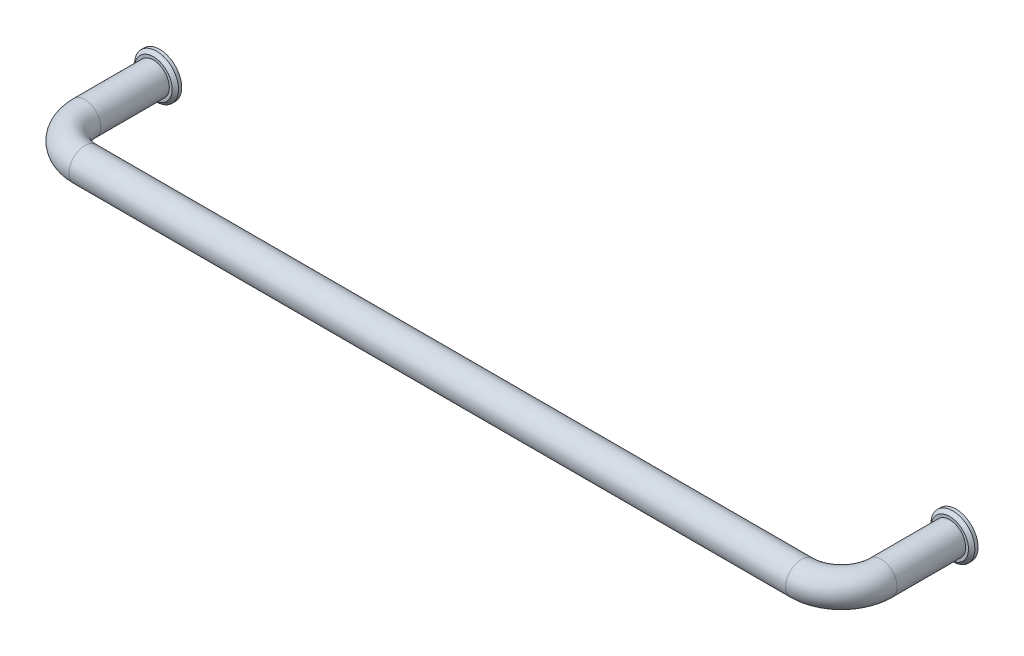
ISO-10303-21;
HEADER;
FILE_DESCRIPTION(('STEP AP214'),'2;1');
FILE_NAME('part.step','',(''),(''),'','','');
FILE_SCHEMA(('AUTOMOTIVE_DESIGN { 1 0 10303 214 1 1 1 1 }'));
ENDSEC;
DATA;
#1=APPLICATION_CONTEXT('core data for automotive mechanical design processes');
#2=APPLICATION_PROTOCOL_DEFINITION('international standard','automotive_design',2000,#1);
#3=PRODUCT_CONTEXT('',#1,'mechanical');
#4=PRODUCT('Part','Part','',(#3));
#5=PRODUCT_RELATED_PRODUCT_CATEGORY('part','',(#4));
#6=PRODUCT_DEFINITION_FORMATION('','',#4);
#7=PRODUCT_DEFINITION_CONTEXT('part definition',#1,'design');
#8=PRODUCT_DEFINITION('design','',#6,#7);
#9=PRODUCT_DEFINITION_SHAPE('','',#8);
#10=(LENGTH_UNIT() NAMED_UNIT(*) SI_UNIT(.MILLI.,.METRE.));
#11=(NAMED_UNIT(*) PLANE_ANGLE_UNIT() SI_UNIT($,.RADIAN.));
#12=(NAMED_UNIT(*) SI_UNIT($,.STERADIAN.) SOLID_ANGLE_UNIT());
#13=UNCERTAINTY_MEASURE_WITH_UNIT(LENGTH_MEASURE(1.E-05),#10,'distance_accuracy_value','');
#14=(GEOMETRIC_REPRESENTATION_CONTEXT(3) GLOBAL_UNCERTAINTY_ASSIGNED_CONTEXT((#13)) GLOBAL_UNIT_ASSIGNED_CONTEXT((#10,
#11,#12)) REPRESENTATION_CONTEXT('',''));
#15=CARTESIAN_POINT('',(0.,0.,0.));
#16=DIRECTION('',(0.,0.,1.));
#17=DIRECTION('',(1.,0.,0.));
#18=AXIS2_PLACEMENT_3D('',#15,#16,#17);
#19=CARTESIAN_POINT('',(0.,0.,0.));
#20=DIRECTION('',(0.,0.,1.));
#21=DIRECTION('',(0.,1.,0.));
#22=AXIS2_PLACEMENT_3D('',#19,#20,#21);
#23=PLANE('',#22);
#24=CARTESIAN_POINT('',(0.,0.,0.));
#25=DIRECTION('',(0.,0.,1.));
#26=DIRECTION('',(1.,0.,0.));
#27=AXIS2_PLACEMENT_3D('',#24,#25,#26);
#28=CIRCLE('',#27,6.9);
#29=CARTESIAN_POINT('',(6.9,0.,0.));
#30=VERTEX_POINT('',#29);
#31=EDGE_CURVE('E30',#30,#30,#28,.T.);
#32=ORIENTED_EDGE('',*,*,#31,.F.);
#33=EDGE_LOOP('',(#32));
#34=FACE_BOUND('',#33,.T.);
#35=CARTESIAN_POINT('',(0.,0.,0.));
#36=DIRECTION('',(0.,0.,1.));
#37=DIRECTION('',(0.,1.,0.));
#38=AXIS2_PLACEMENT_3D('',#35,#36,#37);
#39=CIRCLE('',#38,2.5);
#40=CARTESIAN_POINT('',(0.,2.5,0.));
#41=VERTEX_POINT('',#40);
#42=EDGE_CURVE('E16',#41,#41,#39,.F.);
#43=ORIENTED_EDGE('',*,*,#42,.F.);
#44=EDGE_LOOP('',(#43));
#45=FACE_BOUND('',#44,.T.);
#46=ADVANCED_FACE('F12',(#34,#45),#23,.F.);
#47=CARTESIAN_POINT('',(0.,0.,23.5));
#48=DIRECTION('',(0.,0.,-1.));
#49=DIRECTION('',(0.,-1.,0.));
#50=AXIS2_PLACEMENT_3D('',#47,#48,#49);
#51=CYLINDRICAL_SURFACE('',#50,5.);
#52=CARTESIAN_POINT('',(0.,0.,23.5));
#53=DIRECTION('',(0.,0.,1.));
#54=DIRECTION('',(0.,1.,0.));
#55=AXIS2_PLACEMENT_3D('',#52,#53,#54);
#56=CIRCLE('',#55,5.);
#57=CARTESIAN_POINT('',(-5.,0.,23.5));
#58=VERTEX_POINT('',#57);
#59=EDGE_CURVE('E51',#58,#58,#56,.T.);
#60=ORIENTED_EDGE('',*,*,#59,.F.);
#61=EDGE_LOOP('',(#60));
#62=FACE_BOUND('',#61,.T.);
#63=CARTESIAN_POINT('',(0.,0.,2.00000000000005));
#64=DIRECTION('',(0.,0.,-1.));
#65=DIRECTION('',(-1.,0.,0.));
#66=AXIS2_PLACEMENT_3D('',#63,#64,#65);
#67=CIRCLE('',#66,5.);
#68=CARTESIAN_POINT('',(-5.,0.,2.00000000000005));
#69=VERTEX_POINT('',#68);
#70=EDGE_CURVE('E25',#69,#69,#67,.T.);
#71=ORIENTED_EDGE('',*,*,#70,.F.);
#72=EDGE_LOOP('',(#71));
#73=FACE_BOUND('',#72,.T.);
#74=ADVANCED_FACE('F75',(#62,#73),#51,.T.);
#75=CARTESIAN_POINT('',(250.,0.,23.5));
#76=DIRECTION('',(0.,0.,-1.));
#77=DIRECTION('',(-1.,0.,0.));
#78=AXIS2_PLACEMENT_3D('',#75,#76,#77);
#79=CYLINDRICAL_SURFACE('',#78,5.);
#80=CARTESIAN_POINT('',(250.,0.,23.5));
#81=DIRECTION('',(0.,0.,-1.));
#82=DIRECTION('',(0.,1.,0.));
#83=AXIS2_PLACEMENT_3D('',#80,#81,#82);
#84=CIRCLE('',#83,5.);
#85=CARTESIAN_POINT('',(255.,0.,23.5));
#86=VERTEX_POINT('',#85);
#87=EDGE_CURVE('E60',#86,#86,#84,.T.);
#88=ORIENTED_EDGE('',*,*,#87,.T.);
#89=EDGE_LOOP('',(#88));
#90=FACE_BOUND('',#89,.T.);
#91=CARTESIAN_POINT('',(250.,0.,2.00000000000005));
#92=DIRECTION('',(0.,0.,-1.));
#93=DIRECTION('',(-1.,0.,0.));
#94=AXIS2_PLACEMENT_3D('',#91,#92,#93);
#95=CIRCLE('',#94,5.);
#96=CARTESIAN_POINT('',(245.,0.,2.00000000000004));
#97=VERTEX_POINT('',#96);
#98=EDGE_CURVE('E50',#97,#97,#95,.F.);
#99=ORIENTED_EDGE('',*,*,#98,.T.);
#100=EDGE_LOOP('',(#99));
#101=FACE_BOUND('',#100,.T.);
#102=ADVANCED_FACE('F14',(#90,#101),#79,.T.);
#103=CARTESIAN_POINT('',(237.5,0.,23.5));
#104=DIRECTION('',(0.,1.,0.));
#105=DIRECTION('',(-1.,0.,0.));
#106=AXIS2_PLACEMENT_3D('',#103,#104,#105);
#107=TOROIDAL_SURFACE('',#106,12.5,5.);
#108=CARTESIAN_POINT('',(237.5,0.,36.));
#109=DIRECTION('',(1.,0.,0.));
#110=DIRECTION('',(0.,1.,0.));
#111=AXIS2_PLACEMENT_3D('',#108,#109,#110);
#112=CIRCLE('',#111,5.);
#113=CARTESIAN_POINT('',(237.5,0.,41.));
#114=VERTEX_POINT('',#113);
#115=EDGE_CURVE('E57',#114,#114,#112,.T.);
#116=CARTESIAN_POINT('',(237.5,0.,23.5));
#117=DIRECTION('',(0.,1.,0.));
#118=DIRECTION('',(-1.,0.,0.));
#119=AXIS2_PLACEMENT_3D('',#116,#117,#118);
#120=CIRCLE('',#119,17.5);
#121=EDGE_CURVE('',#114,#86,#120,.T.);
#122=ORIENTED_EDGE('',*,*,#115,.T.);
#123=ORIENTED_EDGE('',*,*,#87,.F.);
#124=ORIENTED_EDGE('',*,*,#121,.T.);
#125=ORIENTED_EDGE('',*,*,#121,.F.);
#126=EDGE_LOOP('',(#122,#124,#123,#125));
#127=FACE_BOUND('',#126,.T.);
#128=ADVANCED_FACE('F85',(#127),#107,.T.);
#129=CARTESIAN_POINT('',(12.5,0.,36.));
#130=DIRECTION('',(1.,0.,0.));
#131=DIRECTION('',(0.,0.,-1.));
#132=AXIS2_PLACEMENT_3D('',#129,#130,#131);
#133=CYLINDRICAL_SURFACE('',#132,5.);
#134=CARTESIAN_POINT('',(12.5,0.,36.));
#135=DIRECTION('',(1.,0.,0.));
#136=DIRECTION('',(0.,1.,0.));
#137=AXIS2_PLACEMENT_3D('',#134,#135,#136);
#138=CIRCLE('',#137,5.);
#139=CARTESIAN_POINT('',(12.5,0.,41.));
#140=VERTEX_POINT('',#139);
#141=EDGE_CURVE('E54',#140,#140,#138,.T.);
#142=ORIENTED_EDGE('',*,*,#141,.T.);
#143=EDGE_LOOP('',(#142));
#144=FACE_BOUND('',#143,.T.);
#145=ORIENTED_EDGE('',*,*,#115,.F.);
#146=EDGE_LOOP('',(#145));
#147=FACE_BOUND('',#146,.T.);
#148=ADVANCED_FACE('F97',(#144,#147),#133,.T.);
#149=CARTESIAN_POINT('',(12.5,0.,23.5));
#150=DIRECTION('',(0.,1.,0.));
#151=DIRECTION('',(-1.,0.,0.));
#152=AXIS2_PLACEMENT_3D('',#149,#150,#151);
#153=TOROIDAL_SURFACE('',#152,12.5,5.);
#154=CARTESIAN_POINT('',(12.5,0.,23.5));
#155=DIRECTION('',(0.,1.,0.));
#156=DIRECTION('',(-1.,0.,0.));
#157=AXIS2_PLACEMENT_3D('',#154,#155,#156);
#158=CIRCLE('',#157,17.5);
#159=EDGE_CURVE('',#58,#140,#158,.T.);
#160=ORIENTED_EDGE('',*,*,#59,.T.);
#161=ORIENTED_EDGE('',*,*,#141,.F.);
#162=ORIENTED_EDGE('',*,*,#159,.T.);
#163=ORIENTED_EDGE('',*,*,#159,.F.);
#164=EDGE_LOOP('',(#160,#162,#161,#163));
#165=FACE_BOUND('',#164,.T.);
#166=ADVANCED_FACE('F93',(#165),#153,.T.);
#167=CARTESIAN_POINT('',(250.,0.,2.00000000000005));
#168=DIRECTION('',(0.,0.,-1.));
#169=DIRECTION('',(-1.,0.,0.));
#170=AXIS2_PLACEMENT_3D('',#167,#168,#169);
#171=CYLINDRICAL_SURFACE('',#170,6.9);
#172=CARTESIAN_POINT('',(250.,0.,1.00000000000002));
#173=DIRECTION('',(0.,0.,-1.));
#174=DIRECTION('',(0.,-1.,0.));
#175=AXIS2_PLACEMENT_3D('',#172,#173,#174);
#176=CIRCLE('',#175,6.9);
#177=CARTESIAN_POINT('',(250.,-6.9,1.00000000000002));
#178=VERTEX_POINT('',#177);
#179=EDGE_CURVE('E63',#178,#178,#176,.T.);
#180=ORIENTED_EDGE('',*,*,#179,.T.);
#181=EDGE_LOOP('',(#180));
#182=FACE_BOUND('',#181,.T.);
#183=CARTESIAN_POINT('',(250.,0.,0.));
#184=DIRECTION('',(0.,0.,-1.));
#185=DIRECTION('',(-1.,0.,0.));
#186=AXIS2_PLACEMENT_3D('',#183,#184,#185);
#187=CIRCLE('',#186,6.9);
#188=CARTESIAN_POINT('',(243.1,0.,0.));
#189=VERTEX_POINT('',#188);
#190=EDGE_CURVE('E34',#189,#189,#187,.T.);
#191=ORIENTED_EDGE('',*,*,#190,.F.);
#192=EDGE_LOOP('',(#191));
#193=FACE_BOUND('',#192,.T.);
#194=ADVANCED_FACE('F96',(#182,#193),#171,.T.);
#195=CARTESIAN_POINT('',(250.,0.,2.00000000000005));
#196=DIRECTION('',(0.,0.,-1.));
#197=DIRECTION('',(-1.,0.,0.));
#198=AXIS2_PLACEMENT_3D('',#195,#196,#197);
#199=PLANE('',#198);
#200=CARTESIAN_POINT('',(250.,0.,2.00000000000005));
#201=DIRECTION('',(0.,0.,-1.));
#202=DIRECTION('',(-1.,0.,0.));
#203=AXIS2_PLACEMENT_3D('',#200,#201,#202);
#204=CIRCLE('',#203,5.9);
#205=CARTESIAN_POINT('',(244.1,0.,2.00000000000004));
#206=VERTEX_POINT('',#205);
#207=EDGE_CURVE('E68',#206,#206,#204,.F.);
#208=ORIENTED_EDGE('',*,*,#207,.T.);
#209=EDGE_LOOP('',(#208));
#210=FACE_BOUND('',#209,.T.);
#211=ORIENTED_EDGE('',*,*,#98,.F.);
#212=EDGE_LOOP('',(#211));
#213=FACE_BOUND('',#212,.T.);
#214=ADVANCED_FACE('F112',(#210,#213),#199,.F.);
#215=CARTESIAN_POINT('',(250.,0.,0.));
#216=DIRECTION('',(0.,0.,-1.));
#217=DIRECTION('',(0.,1.,0.));
#218=AXIS2_PLACEMENT_3D('',#215,#216,#217);
#219=PLANE('',#218);
#220=CARTESIAN_POINT('',(250.,0.,0.));
#221=DIRECTION('',(0.,0.,-1.));
#222=DIRECTION('',(-1.,0.,0.));
#223=AXIS2_PLACEMENT_3D('',#220,#221,#222);
#224=CIRCLE('',#223,2.5);
#225=CARTESIAN_POINT('',(247.5,0.,0.));
#226=VERTEX_POINT('',#225);
#227=EDGE_CURVE('E28',#226,#226,#224,.T.);
#228=ORIENTED_EDGE('',*,*,#227,.F.);
#229=EDGE_LOOP('',(#228));
#230=FACE_BOUND('',#229,.T.);
#231=ORIENTED_EDGE('',*,*,#190,.T.);
#232=EDGE_LOOP('',(#231));
#233=FACE_BOUND('',#232,.T.);
#234=ADVANCED_FACE('F92',(#230,#233),#219,.T.);
#235=CARTESIAN_POINT('',(250.,0.,1.00000000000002));
#236=DIRECTION('',(0.,0.,-1.));
#237=DIRECTION('',(0.,-1.,0.));
#238=AXIS2_PLACEMENT_3D('',#235,#236,#237);
#239=CONICAL_SURFACE('',#238,6.9,0.785398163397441);
#240=ORIENTED_EDGE('',*,*,#207,.F.);
#241=EDGE_LOOP('',(#240));
#242=FACE_BOUND('',#241,.T.);
#243=ORIENTED_EDGE('',*,*,#179,.F.);
#244=EDGE_LOOP('',(#243));
#245=FACE_BOUND('',#244,.T.);
#246=ADVANCED_FACE('F121',(#242,#245),#239,.T.);
#247=CARTESIAN_POINT('',(0.,0.,2.00000000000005));
#248=DIRECTION('',(0.,0.,-1.));
#249=DIRECTION('',(1.,0.,0.));
#250=AXIS2_PLACEMENT_3D('',#247,#248,#249);
#251=PLANE('',#250);
#252=CARTESIAN_POINT('',(0.,0.,2.00000000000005));
#253=DIRECTION('',(0.,0.,-1.));
#254=DIRECTION('',(-1.,0.,0.));
#255=AXIS2_PLACEMENT_3D('',#252,#253,#254);
#256=CIRCLE('',#255,5.9);
#257=CARTESIAN_POINT('',(-5.9,0.,2.00000000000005));
#258=VERTEX_POINT('',#257);
#259=EDGE_CURVE('E20',#258,#258,#256,.F.);
#260=ORIENTED_EDGE('',*,*,#259,.T.);
#261=EDGE_LOOP('',(#260));
#262=FACE_BOUND('',#261,.T.);
#263=ORIENTED_EDGE('',*,*,#70,.T.);
#264=EDGE_LOOP('',(#263));
#265=FACE_BOUND('',#264,.T.);
#266=ADVANCED_FACE('F73',(#262,#265),#251,.F.);
#267=CARTESIAN_POINT('',(0.,0.,2.00000000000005));
#268=DIRECTION('',(0.,0.,-1.));
#269=DIRECTION('',(-1.,0.,0.));
#270=AXIS2_PLACEMENT_3D('',#267,#268,#269);
#271=CYLINDRICAL_SURFACE('',#270,6.9);
#272=CARTESIAN_POINT('',(0.,0.,1.00000000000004));
#273=DIRECTION('',(0.,0.,-1.));
#274=DIRECTION('',(0.,-1.,0.));
#275=AXIS2_PLACEMENT_3D('',#272,#273,#274);
#276=CIRCLE('',#275,6.9);
#277=CARTESIAN_POINT('',(0.,-6.9,1.00000000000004));
#278=VERTEX_POINT('',#277);
#279=EDGE_CURVE('E8',#278,#278,#276,.T.);
#280=ORIENTED_EDGE('',*,*,#279,.T.);
#281=EDGE_LOOP('',(#280));
#282=FACE_BOUND('',#281,.T.);
#283=ORIENTED_EDGE('',*,*,#31,.T.);
#284=EDGE_LOOP('',(#283));
#285=FACE_BOUND('',#284,.T.);
#286=ADVANCED_FACE('F129',(#282,#285),#271,.T.);
#287=CARTESIAN_POINT('',(0.,0.,2.00000000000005));
#288=DIRECTION('',(0.,0.,-1.));
#289=DIRECTION('',(0.,-1.,0.));
#290=AXIS2_PLACEMENT_3D('',#287,#288,#289);
#291=CONICAL_SURFACE('',#290,5.9,0.785398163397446);
#292=ORIENTED_EDGE('',*,*,#279,.F.);
#293=EDGE_LOOP('',(#292));
#294=FACE_BOUND('',#293,.T.);
#295=ORIENTED_EDGE('',*,*,#259,.F.);
#296=EDGE_LOOP('',(#295));
#297=FACE_BOUND('',#296,.T.);
#298=ADVANCED_FACE('F132',(#294,#297),#291,.T.);
#299=CARTESIAN_POINT('',(250.,0.,-8.));
#300=DIRECTION('',(0.,0.,1.));
#301=DIRECTION('',(1.,0.,0.));
#302=AXIS2_PLACEMENT_3D('',#299,#300,#301);
#303=CYLINDRICAL_SURFACE('',#302,2.5);
#304=ORIENTED_EDGE('',*,*,#227,.T.);
#305=EDGE_LOOP('',(#304));
#306=FACE_BOUND('',#305,.T.);
#307=CARTESIAN_POINT('',(250.,0.,11.));
#308=DIRECTION('',(0.,0.,-1.));
#309=DIRECTION('',(-1.,0.,0.));
#310=AXIS2_PLACEMENT_3D('',#307,#308,#309);
#311=CIRCLE('',#310,2.5);
#312=CARTESIAN_POINT('',(247.5,0.,11.));
#313=VERTEX_POINT('',#312);
#314=EDGE_CURVE('E41',#313,#313,#311,.T.);
#315=ORIENTED_EDGE('',*,*,#314,.F.);
#316=EDGE_LOOP('',(#315));
#317=FACE_BOUND('',#316,.T.);
#318=ADVANCED_FACE('F138',(#306,#317),#303,.F.);
#319=CARTESIAN_POINT('',(0.,0.,-8.));
#320=DIRECTION('',(0.,0.,1.));
#321=DIRECTION('',(1.,0.,0.));
#322=AXIS2_PLACEMENT_3D('',#319,#320,#321);
#323=CYLINDRICAL_SURFACE('',#322,2.5);
#324=ORIENTED_EDGE('',*,*,#42,.T.);
#325=EDGE_LOOP('',(#324));
#326=FACE_BOUND('',#325,.T.);
#327=CARTESIAN_POINT('',(0.,0.,11.));
#328=DIRECTION('',(0.,0.,-1.));
#329=DIRECTION('',(-1.,0.,0.));
#330=AXIS2_PLACEMENT_3D('',#327,#328,#329);
#331=CIRCLE('',#330,2.5);
#332=CARTESIAN_POINT('',(-2.5,0.,11.));
#333=VERTEX_POINT('',#332);
#334=EDGE_CURVE('E37',#333,#333,#331,.T.);
#335=ORIENTED_EDGE('',*,*,#334,.F.);
#336=EDGE_LOOP('',(#335));
#337=FACE_BOUND('',#336,.T.);
#338=ADVANCED_FACE('F142',(#326,#337),#323,.F.);
#339=CARTESIAN_POINT('',(0.,0.,11.));
#340=DIRECTION('',(0.,0.,-1.));
#341=DIRECTION('',(-1.,0.,0.));
#342=AXIS2_PLACEMENT_3D('',#339,#340,#341);
#343=PLANE('',#342);
#344=ORIENTED_EDGE('',*,*,#334,.T.);
#345=EDGE_LOOP('',(#344));
#346=FACE_BOUND('',#345,.T.);
#347=ADVANCED_FACE('F145',(#346),#343,.T.);
#348=CARTESIAN_POINT('',(250.,0.,11.));
#349=DIRECTION('',(0.,0.,-1.));
#350=DIRECTION('',(-1.,0.,0.));
#351=AXIS2_PLACEMENT_3D('',#348,#349,#350);
#352=PLANE('',#351);
#353=ORIENTED_EDGE('',*,*,#314,.T.);
#354=EDGE_LOOP('',(#353));
#355=FACE_BOUND('',#354,.T.);
#356=ADVANCED_FACE('F148',(#355),#352,.T.);
#357=CLOSED_SHELL('',(#46,#74,#102,#128,#148,#166,#194,#214,#234,#246,#266,#286,#298,#318,#338,
#347,#356));
#358=MANIFOLD_SOLID_BREP('B1',#357);
#359=ADVANCED_BREP_SHAPE_REPRESENTATION('',(#18,#358),#14);
#360=SHAPE_DEFINITION_REPRESENTATION(#9,#359);
ENDSEC;
END-ISO-10303-21;
